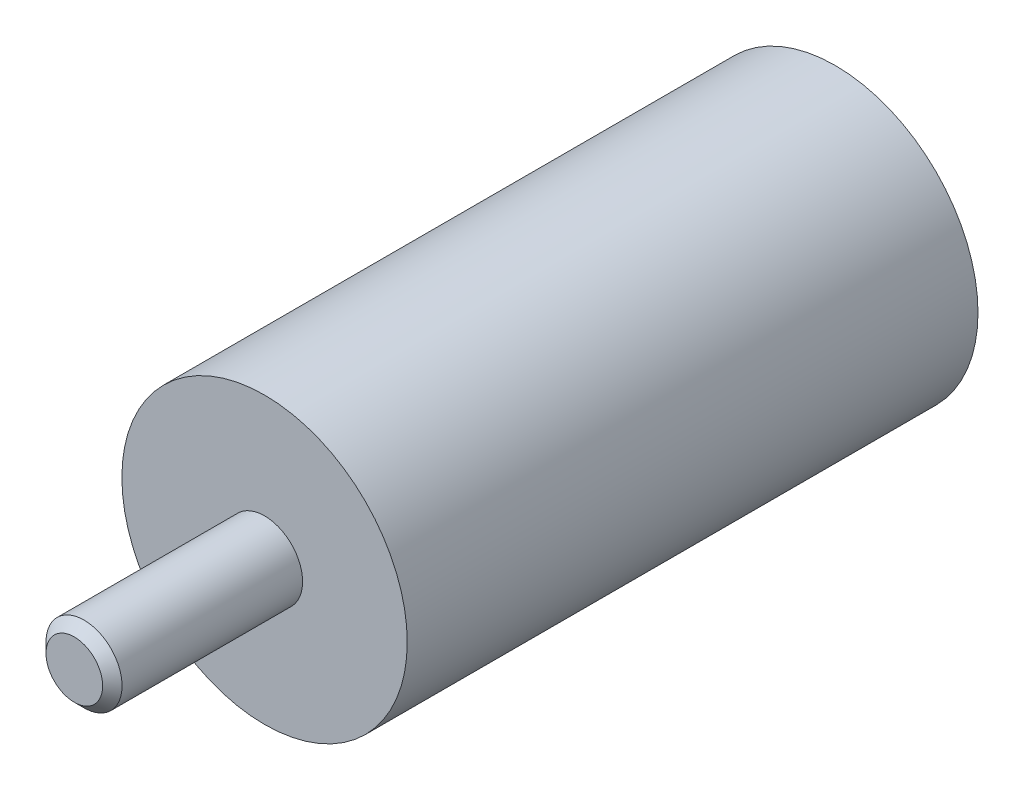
ISO-10303-21;
HEADER;
FILE_DESCRIPTION(('STEP AP214'),'2;1');
FILE_NAME('part.step','',(''),(''),'','','');
FILE_SCHEMA(('AUTOMOTIVE_DESIGN { 1 0 10303 214 1 1 1 1 }'));
ENDSEC;
DATA;
#1=APPLICATION_CONTEXT('core data for automotive mechanical design processes');
#2=APPLICATION_PROTOCOL_DEFINITION('international standard','automotive_design',2000,#1);
#3=PRODUCT_CONTEXT('',#1,'mechanical');
#4=PRODUCT('Part','Part','',(#3));
#5=PRODUCT_RELATED_PRODUCT_CATEGORY('part','',(#4));
#6=PRODUCT_DEFINITION_FORMATION('','',#4);
#7=PRODUCT_DEFINITION_CONTEXT('part definition',#1,'design');
#8=PRODUCT_DEFINITION('design','',#6,#7);
#9=PRODUCT_DEFINITION_SHAPE('','',#8);
#10=(LENGTH_UNIT() NAMED_UNIT(*) SI_UNIT(.MILLI.,.METRE.));
#11=(NAMED_UNIT(*) PLANE_ANGLE_UNIT() SI_UNIT($,.RADIAN.));
#12=(NAMED_UNIT(*) SI_UNIT($,.STERADIAN.) SOLID_ANGLE_UNIT());
#13=UNCERTAINTY_MEASURE_WITH_UNIT(LENGTH_MEASURE(1.E-05),#10,'distance_accuracy_value','');
#14=(GEOMETRIC_REPRESENTATION_CONTEXT(3) GLOBAL_UNCERTAINTY_ASSIGNED_CONTEXT((#13)) GLOBAL_UNIT_ASSIGNED_CONTEXT((#10,
#11,#12)) REPRESENTATION_CONTEXT('',''));
#15=CARTESIAN_POINT('',(0.,0.,0.));
#16=DIRECTION('',(0.,0.,1.));
#17=DIRECTION('',(1.,0.,0.));
#18=AXIS2_PLACEMENT_3D('',#15,#16,#17);
#19=CARTESIAN_POINT('',(7.5,0.,30.));
#20=DIRECTION('',(0.,0.,1.));
#21=DIRECTION('',(0.,-1.,0.));
#22=AXIS2_PLACEMENT_3D('',#19,#20,#21);
#23=PLANE('',#22);
#24=CARTESIAN_POINT('',(0.,0.,30.));
#25=DIRECTION('',(0.,0.,-1.));
#26=DIRECTION('',(0.,1.,0.));
#27=AXIS2_PLACEMENT_3D('',#24,#25,#26);
#28=CIRCLE('',#27,2.);
#29=CARTESIAN_POINT('',(0.,2.,30.));
#30=VERTEX_POINT('',#29);
#31=EDGE_CURVE('E23',#30,#30,#28,.T.);
#32=ORIENTED_EDGE('',*,*,#31,.T.);
#33=EDGE_LOOP('',(#32));
#34=FACE_BOUND('',#33,.T.);
#35=CARTESIAN_POINT('',(0.,0.,30.));
#36=DIRECTION('',(0.,0.,-1.));
#37=DIRECTION('',(0.,1.,0.));
#38=AXIS2_PLACEMENT_3D('',#35,#36,#37);
#39=CIRCLE('',#38,7.5);
#40=CARTESIAN_POINT('',(0.,7.5,30.));
#41=VERTEX_POINT('',#40);
#42=EDGE_CURVE('E19',#41,#41,#39,.T.);
#43=ORIENTED_EDGE('',*,*,#42,.F.);
#44=EDGE_LOOP('',(#43));
#45=FACE_BOUND('',#44,.T.);
#46=ADVANCED_FACE('F12',(#34,#45),#23,.T.);
#47=CARTESIAN_POINT('',(0.,0.,0.));
#48=DIRECTION('',(0.,0.,-1.));
#49=DIRECTION('',(0.,1.,0.));
#50=AXIS2_PLACEMENT_3D('',#47,#48,#49);
#51=CYLINDRICAL_SURFACE('',#50,2.);
#52=CARTESIAN_POINT('',(0.,0.,39.4889744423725));
#53=DIRECTION('',(0.,0.,-1.));
#54=DIRECTION('',(0.,1.,0.));
#55=AXIS2_PLACEMENT_3D('',#52,#53,#54);
#56=CIRCLE('',#55,2.);
#57=CARTESIAN_POINT('',(0.,2.,39.4889744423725));
#58=VERTEX_POINT('',#57);
#59=EDGE_CURVE('E27',#58,#58,#56,.T.);
#60=ORIENTED_EDGE('',*,*,#59,.T.);
#61=EDGE_LOOP('',(#60));
#62=FACE_BOUND('',#61,.T.);
#63=ORIENTED_EDGE('',*,*,#31,.F.);
#64=EDGE_LOOP('',(#63));
#65=FACE_BOUND('',#64,.T.);
#66=ADVANCED_FACE('F48',(#62,#65),#51,.T.);
#67=CARTESIAN_POINT('',(0.,0.,39.4889744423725));
#68=DIRECTION('',(0.,0.,-1.));
#69=DIRECTION('',(0.,1.,0.));
#70=AXIS2_PLACEMENT_3D('',#67,#68,#69);
#71=CONICAL_SURFACE('',#70,2.,0.78539816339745);
#72=CARTESIAN_POINT('',(0.,0.,40.));
#73=DIRECTION('',(0.,0.,-1.));
#74=DIRECTION('',(0.,1.,0.));
#75=AXIS2_PLACEMENT_3D('',#72,#73,#74);
#76=CIRCLE('',#75,1.48897444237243);
#77=CARTESIAN_POINT('',(0.,1.48897444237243,40.));
#78=VERTEX_POINT('',#77);
#79=EDGE_CURVE('E32',#78,#78,#76,.T.);
#80=ORIENTED_EDGE('',*,*,#79,.T.);
#81=EDGE_LOOP('',(#80));
#82=FACE_BOUND('',#81,.T.);
#83=ORIENTED_EDGE('',*,*,#59,.F.);
#84=EDGE_LOOP('',(#83));
#85=FACE_BOUND('',#84,.T.);
#86=ADVANCED_FACE('F36',(#82,#85),#71,.T.);
#87=CARTESIAN_POINT('',(1.48897444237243,0.,40.));
#88=DIRECTION('',(0.,0.,1.));
#89=DIRECTION('',(0.,-1.,0.));
#90=AXIS2_PLACEMENT_3D('',#87,#88,#89);
#91=PLANE('',#90);
#92=ORIENTED_EDGE('',*,*,#79,.F.);
#93=EDGE_LOOP('',(#92));
#94=FACE_BOUND('',#93,.T.);
#95=ADVANCED_FACE('F39',(#94),#91,.T.);
#96=CARTESIAN_POINT('',(0.,0.,0.));
#97=DIRECTION('',(0.,0.,1.));
#98=DIRECTION('',(0.,-1.,0.));
#99=AXIS2_PLACEMENT_3D('',#96,#97,#98);
#100=CYLINDRICAL_SURFACE('',#99,7.5);
#101=CARTESIAN_POINT('',(0.,0.,0.));
#102=DIRECTION('',(0.,0.,1.));
#103=DIRECTION('',(0.,-1.,0.));
#104=AXIS2_PLACEMENT_3D('',#101,#102,#103);
#105=CIRCLE('',#104,7.5);
#106=CARTESIAN_POINT('',(0.,-7.5,0.));
#107=VERTEX_POINT('',#106);
#108=EDGE_CURVE('E8',#107,#107,#105,.T.);
#109=ORIENTED_EDGE('',*,*,#108,.T.);
#110=EDGE_LOOP('',(#109));
#111=FACE_BOUND('',#110,.T.);
#112=ORIENTED_EDGE('',*,*,#42,.T.);
#113=EDGE_LOOP('',(#112));
#114=FACE_BOUND('',#113,.T.);
#115=ADVANCED_FACE('F14',(#111,#114),#100,.T.);
#116=CARTESIAN_POINT('',(7.5,0.,0.));
#117=DIRECTION('',(0.,0.,-1.));
#118=DIRECTION('',(0.,1.,0.));
#119=AXIS2_PLACEMENT_3D('',#116,#117,#118);
#120=PLANE('',#119);
#121=ORIENTED_EDGE('',*,*,#108,.F.);
#122=EDGE_LOOP('',(#121));
#123=FACE_BOUND('',#122,.T.);
#124=ADVANCED_FACE('F47',(#123),#120,.T.);
#125=CLOSED_SHELL('',(#46,#66,#86,#95,#115,#124));
#126=MANIFOLD_SOLID_BREP('B1',#125);
#127=ADVANCED_BREP_SHAPE_REPRESENTATION('',(#18,#126),#14);
#128=SHAPE_DEFINITION_REPRESENTATION(#9,#127);
ENDSEC;
END-ISO-10303-21;
